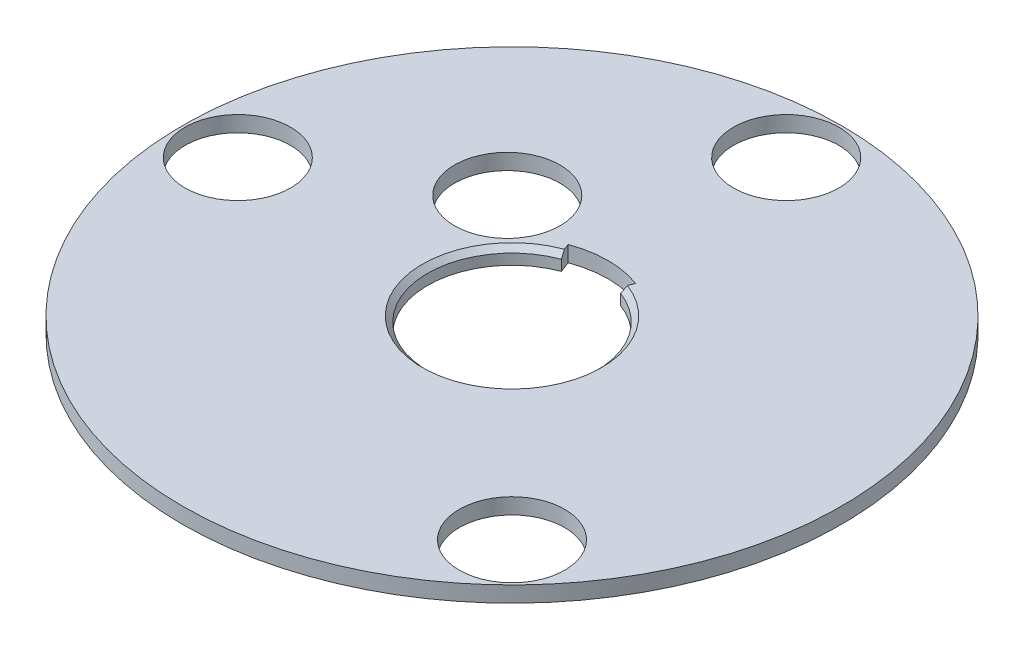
ISO-10303-21;
HEADER;
FILE_DESCRIPTION(('STEP AP214'),'2;1');
FILE_NAME('part.step','',(''),(''),'','','');
FILE_SCHEMA(('AUTOMOTIVE_DESIGN { 1 0 10303 214 1 1 1 1 }'));
ENDSEC;
DATA;
#1=APPLICATION_CONTEXT('core data for automotive mechanical design processes');
#2=APPLICATION_PROTOCOL_DEFINITION('international standard','automotive_design',2000,#1);
#3=PRODUCT_CONTEXT('',#1,'mechanical');
#4=PRODUCT('Part','Part','',(#3));
#5=PRODUCT_RELATED_PRODUCT_CATEGORY('part','',(#4));
#6=PRODUCT_DEFINITION_FORMATION('','',#4);
#7=PRODUCT_DEFINITION_CONTEXT('part definition',#1,'design');
#8=PRODUCT_DEFINITION('design','',#6,#7);
#9=PRODUCT_DEFINITION_SHAPE('','',#8);
#10=(LENGTH_UNIT() NAMED_UNIT(*) SI_UNIT(.MILLI.,.METRE.));
#11=(NAMED_UNIT(*) PLANE_ANGLE_UNIT() SI_UNIT($,.RADIAN.));
#12=(NAMED_UNIT(*) SI_UNIT($,.STERADIAN.) SOLID_ANGLE_UNIT());
#13=UNCERTAINTY_MEASURE_WITH_UNIT(LENGTH_MEASURE(1.E-05),#10,'distance_accuracy_value','');
#14=(GEOMETRIC_REPRESENTATION_CONTEXT(3) GLOBAL_UNCERTAINTY_ASSIGNED_CONTEXT((#13)) GLOBAL_UNIT_ASSIGNED_CONTEXT((#10,
#11,#12)) REPRESENTATION_CONTEXT('',''));
#15=CARTESIAN_POINT('',(0.,0.,0.));
#16=DIRECTION('',(0.,0.,1.));
#17=DIRECTION('',(1.,0.,0.));
#18=AXIS2_PLACEMENT_3D('',#15,#16,#17);
#19=CARTESIAN_POINT('',(0.,-1.5,0.));
#20=DIRECTION('',(0.,1.,0.));
#21=DIRECTION('',(0.,0.,1.));
#22=AXIS2_PLACEMENT_3D('',#19,#20,#21);
#23=CYLINDRICAL_SURFACE('',#22,31.25);
#24=CARTESIAN_POINT('',(0.,-1.5,0.));
#25=DIRECTION('',(0.,1.,0.));
#26=DIRECTION('',(0.,0.,1.));
#27=AXIS2_PLACEMENT_3D('',#24,#25,#26);
#28=CIRCLE('',#27,31.25);
#29=CARTESIAN_POINT('',(0.,-1.5,31.25));
#30=VERTEX_POINT('',#29);
#31=EDGE_CURVE('E121',#30,#30,#28,.T.);
#32=ORIENTED_EDGE('',*,*,#31,.T.);
#33=EDGE_LOOP('',(#32));
#34=FACE_BOUND('',#33,.T.);
#35=CARTESIAN_POINT('',(0.,0.,0.));
#36=DIRECTION('',(0.,1.,0.));
#37=DIRECTION('',(0.,0.,1.));
#38=AXIS2_PLACEMENT_3D('',#35,#36,#37);
#39=CIRCLE('',#38,31.25);
#40=CARTESIAN_POINT('',(0.,0.,31.25));
#41=VERTEX_POINT('',#40);
#42=EDGE_CURVE('E116',#41,#41,#39,.T.);
#43=ORIENTED_EDGE('',*,*,#42,.F.);
#44=EDGE_LOOP('',(#43));
#45=FACE_BOUND('',#44,.T.);
#46=ADVANCED_FACE('F32',(#34,#45),#23,.T.);
#47=CARTESIAN_POINT('',(0.,-1.5,0.));
#48=DIRECTION('',(0.,1.,0.));
#49=DIRECTION('',(0.,0.,1.));
#50=AXIS2_PLACEMENT_3D('',#47,#48,#49);
#51=PLANE('',#50);
#52=CARTESIAN_POINT('',(-25.9999999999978,-1.5,2.21689333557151E-12));
#53=DIRECTION('',(0.,1.,0.));
#54=DIRECTION('',(0.,0.,1.));
#55=AXIS2_PLACEMENT_3D('',#52,#53,#54);
#56=CIRCLE('',#55,5.00000000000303);
#57=CARTESIAN_POINT('',(-25.9999999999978,-1.5,5.00000000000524));
#58=VERTEX_POINT('',#57);
#59=EDGE_CURVE('E179',#58,#58,#56,.T.);
#60=ORIENTED_EDGE('',*,*,#59,.T.);
#61=EDGE_LOOP('',(#60));
#62=FACE_BOUND('',#61,.T.);
#63=CARTESIAN_POINT('',(18.384776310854,-1.5,18.3847763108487));
#64=DIRECTION('',(0.,1.,0.));
#65=DIRECTION('',(0.,0.,1.));
#66=AXIS2_PLACEMENT_3D('',#63,#64,#65);
#67=CIRCLE('',#66,5.00000000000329);
#68=CARTESIAN_POINT('',(18.384776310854,-1.5,23.384776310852));
#69=VERTEX_POINT('',#68);
#70=EDGE_CURVE('E187',#69,#69,#67,.T.);
#71=ORIENTED_EDGE('',*,*,#70,.T.);
#72=EDGE_LOOP('',(#71));
#73=FACE_BOUND('',#72,.T.);
#74=CARTESIAN_POINT('',(-10.1214166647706,-1.5,-9.67248286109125));
#75=DIRECTION('',(0.,1.,0.));
#76=DIRECTION('',(0.,0.,1.));
#77=AXIS2_PLACEMENT_3D('',#74,#75,#76);
#78=CIRCLE('',#77,5.);
#79=CARTESIAN_POINT('',(-10.1214166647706,-1.5,-4.67248286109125));
#80=VERTEX_POINT('',#79);
#81=EDGE_CURVE('E193',#80,#80,#78,.T.);
#82=ORIENTED_EDGE('',*,*,#81,.T.);
#83=EDGE_LOOP('',(#82));
#84=FACE_BOUND('',#83,.T.);
#85=CARTESIAN_POINT('',(0.,-1.5,-26.));
#86=DIRECTION('',(0.,1.,0.));
#87=DIRECTION('',(0.,0.,1.));
#88=AXIS2_PLACEMENT_3D('',#85,#86,#87);
#89=CIRCLE('',#88,5.);
#90=CARTESIAN_POINT('',(0.,-1.5,-21.));
#91=VERTEX_POINT('',#90);
#92=EDGE_CURVE('E112',#91,#91,#89,.T.);
#93=ORIENTED_EDGE('',*,*,#92,.T.);
#94=EDGE_LOOP('',(#93));
#95=FACE_BOUND('',#94,.T.);
#96=CARTESIAN_POINT('',(0.,-1.5,0.));
#97=DIRECTION('',(0.,1.,0.));
#98=DIRECTION('',(0.,0.,1.));
#99=AXIS2_PLACEMENT_3D('',#96,#97,#98);
#100=CIRCLE('',#99,8.);
#101=CARTESIAN_POINT('',(-2.80898753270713,-1.5,-7.49063342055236));
#102=VERTEX_POINT('',#101);
#103=CARTESIAN_POINT('',(2.80898753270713,-1.5,-7.49063342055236));
#104=VERTEX_POINT('',#103);
#105=EDGE_CURVE('E87',#102,#104,#100,.T.);
#106=ORIENTED_EDGE('',*,*,#105,.T.);
#107=DIRECTION('',(0.351123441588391,0.,-0.936329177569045));
#108=VECTOR('',#107,1.);
#109=CARTESIAN_POINT('',(3.,-1.5,-8.));
#110=LINE('',#109,#108);
#111=CARTESIAN_POINT('',(3.19522331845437,-1.5,-8.5205955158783));
#112=VERTEX_POINT('',#111);
#113=EDGE_CURVE('E80',#104,#112,#110,.T.);
#114=ORIENTED_EDGE('',*,*,#113,.T.);
#115=CARTESIAN_POINT('',(0.,-1.5,0.));
#116=DIRECTION('',(0.,1.,0.));
#117=DIRECTION('',(0.,0.,1.));
#118=AXIS2_PLACEMENT_3D('',#115,#116,#117);
#119=CIRCLE('',#118,9.1);
#120=CARTESIAN_POINT('',(-3.19522331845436,-1.5,-8.52059551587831));
#121=VERTEX_POINT('',#120);
#122=EDGE_CURVE('E91',#112,#121,#119,.T.);
#123=ORIENTED_EDGE('',*,*,#122,.T.);
#124=DIRECTION('',(0.351123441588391,0.,0.936329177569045));
#125=VECTOR('',#124,1.);
#126=CARTESIAN_POINT('',(-3.,-1.5,-8.));
#127=LINE('',#126,#125);
#128=EDGE_CURVE('E95',#121,#102,#127,.T.);
#129=ORIENTED_EDGE('',*,*,#128,.T.);
#130=EDGE_LOOP('',(#106,#114,#123,#129));
#131=FACE_BOUND('',#130,.T.);
#132=ORIENTED_EDGE('',*,*,#31,.F.);
#133=EDGE_LOOP('',(#132));
#134=FACE_BOUND('',#133,.T.);
#135=ADVANCED_FACE('F98',(#62,#73,#84,#95,#131,#134),#51,.F.);
#136=CARTESIAN_POINT('',(0.,0.,0.));
#137=DIRECTION('',(0.,1.,0.));
#138=DIRECTION('',(0.,0.,1.));
#139=AXIS2_PLACEMENT_3D('',#136,#137,#138);
#140=PLANE('',#139);
#141=CARTESIAN_POINT('',(-25.9999999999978,0.,2.21689333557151E-12));
#142=DIRECTION('',(0.,1.,0.));
#143=DIRECTION('',(0.,0.,1.));
#144=AXIS2_PLACEMENT_3D('',#141,#142,#143);
#145=CIRCLE('',#144,5.00000000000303);
#146=CARTESIAN_POINT('',(-25.9999999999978,0.,5.00000000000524));
#147=VERTEX_POINT('',#146);
#148=EDGE_CURVE('E182',#147,#147,#145,.T.);
#149=ORIENTED_EDGE('',*,*,#148,.F.);
#150=EDGE_LOOP('',(#149));
#151=FACE_BOUND('',#150,.T.);
#152=CARTESIAN_POINT('',(18.384776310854,0.,18.3847763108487));
#153=DIRECTION('',(0.,1.,0.));
#154=DIRECTION('',(0.,0.,1.));
#155=AXIS2_PLACEMENT_3D('',#152,#153,#154);
#156=CIRCLE('',#155,5.00000000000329);
#157=CARTESIAN_POINT('',(18.384776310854,0.,23.384776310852));
#158=VERTEX_POINT('',#157);
#159=EDGE_CURVE('E184',#158,#158,#156,.T.);
#160=ORIENTED_EDGE('',*,*,#159,.F.);
#161=EDGE_LOOP('',(#160));
#162=FACE_BOUND('',#161,.T.);
#163=CARTESIAN_POINT('',(-10.1214166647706,0.,-9.67248286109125));
#164=DIRECTION('',(0.,1.,0.));
#165=DIRECTION('',(0.,0.,1.));
#166=AXIS2_PLACEMENT_3D('',#163,#164,#165);
#167=CIRCLE('',#166,5.);
#168=CARTESIAN_POINT('',(-10.1214166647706,0.,-4.67248286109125));
#169=VERTEX_POINT('',#168);
#170=EDGE_CURVE('E190',#169,#169,#167,.T.);
#171=ORIENTED_EDGE('',*,*,#170,.F.);
#172=EDGE_LOOP('',(#171));
#173=FACE_BOUND('',#172,.T.);
#174=CARTESIAN_POINT('',(0.,0.,-26.));
#175=DIRECTION('',(0.,1.,0.));
#176=DIRECTION('',(0.,0.,1.));
#177=AXIS2_PLACEMENT_3D('',#174,#175,#176);
#178=CIRCLE('',#177,5.);
#179=CARTESIAN_POINT('',(0.,0.,-21.));
#180=VERTEX_POINT('',#179);
#181=EDGE_CURVE('E105',#180,#180,#178,.T.);
#182=ORIENTED_EDGE('',*,*,#181,.F.);
#183=EDGE_LOOP('',(#182));
#184=FACE_BOUND('',#183,.T.);
#185=DIRECTION('',(0.351123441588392,0.,-0.936329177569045));
#186=VECTOR('',#185,1.);
#187=CARTESIAN_POINT('',(2.80898753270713,0.,-7.49063342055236));
#188=LINE('',#187,#186);
#189=CARTESIAN_POINT('',(2.98454925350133,0.,-7.95879800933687));
#190=VERTEX_POINT('',#189);
#191=CARTESIAN_POINT('',(3.19522331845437,0.,-8.52059551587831));
#192=VERTEX_POINT('',#191);
#193=EDGE_CURVE('E82',#190,#192,#188,.T.);
#194=ORIENTED_EDGE('',*,*,#193,.F.);
#195=CARTESIAN_POINT('',(0.,0.,0.));
#196=DIRECTION('',(0.,1.,0.));
#197=DIRECTION('',(0.,0.,1.));
#198=AXIS2_PLACEMENT_3D('',#195,#196,#197);
#199=CIRCLE('',#198,8.49999999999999);
#200=CARTESIAN_POINT('',(-2.98454925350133,0.,-7.95879800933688));
#201=VERTEX_POINT('',#200);
#202=EDGE_CURVE('E40',#190,#201,#199,.F.);
#203=ORIENTED_EDGE('',*,*,#202,.T.);
#204=DIRECTION('',(0.351123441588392,0.,0.936329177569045));
#205=VECTOR('',#204,1.);
#206=CARTESIAN_POINT('',(-2.80898753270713,0.,-7.49063342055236));
#207=LINE('',#206,#205);
#208=CARTESIAN_POINT('',(-3.19522331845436,0.,-8.52059551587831));
#209=VERTEX_POINT('',#208);
#210=EDGE_CURVE('E102',#209,#201,#207,.T.);
#211=ORIENTED_EDGE('',*,*,#210,.F.);
#212=CARTESIAN_POINT('',(0.,0.,0.));
#213=DIRECTION('',(0.,1.,0.));
#214=DIRECTION('',(0.,0.,1.));
#215=AXIS2_PLACEMENT_3D('',#212,#213,#214);
#216=CIRCLE('',#215,9.1);
#217=EDGE_CURVE('E110',#192,#209,#216,.T.);
#218=ORIENTED_EDGE('',*,*,#217,.F.);
#219=EDGE_LOOP('',(#194,#203,#211,#218));
#220=FACE_BOUND('',#219,.T.);
#221=ORIENTED_EDGE('',*,*,#42,.T.);
#222=EDGE_LOOP('',(#221));
#223=FACE_BOUND('',#222,.T.);
#224=ADVANCED_FACE('F136',(#151,#162,#173,#184,#220,#223),#140,.T.);
#225=CARTESIAN_POINT('',(2.80898753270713,-1.5,-7.49063342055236));
#226=DIRECTION('',(0.936329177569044,0.,0.351123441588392));
#227=DIRECTION('',(0.351123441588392,0.,-0.936329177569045));
#228=AXIS2_PLACEMENT_3D('',#225,#226,#227);
#229=PLANE('',#228);
#230=DIRECTION('',(0.,1.,0.));
#231=VECTOR('',#230,1.);
#232=CARTESIAN_POINT('',(2.80898753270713,-1.5,-7.49063342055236));
#233=LINE('',#232,#231);
#234=CARTESIAN_POINT('',(2.80898753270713,-0.49999999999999,-7.49063342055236));
#235=VERTEX_POINT('',#234);
#236=EDGE_CURVE('E114',#104,#235,#233,.T.);
#237=ORIENTED_EDGE('',*,*,#236,.T.);
#238=DIRECTION('',(0.24828176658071,0.707106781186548,-0.662084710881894));
#239=VECTOR('',#238,1.);
#240=CARTESIAN_POINT('',(0.,-8.49999999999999,0.));
#241=LINE('',#240,#239);
#242=EDGE_CURVE('E54',#235,#190,#241,.T.);
#243=ORIENTED_EDGE('',*,*,#242,.T.);
#244=ORIENTED_EDGE('',*,*,#193,.T.);
#245=DIRECTION('',(0.,1.,0.));
#246=VECTOR('',#245,1.);
#247=CARTESIAN_POINT('',(3.19522331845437,-1.5,-8.5205955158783));
#248=LINE('',#247,#246);
#249=EDGE_CURVE('E76',#112,#192,#248,.T.);
#250=ORIENTED_EDGE('',*,*,#249,.F.);
#251=ORIENTED_EDGE('',*,*,#113,.F.);
#252=EDGE_LOOP('',(#237,#243,#244,#250,#251));
#253=FACE_BOUND('',#252,.T.);
#254=ADVANCED_FACE('F78',(#253),#229,.F.);
#255=CARTESIAN_POINT('',(0.,-1.5,0.));
#256=DIRECTION('',(0.,1.,0.));
#257=DIRECTION('',(0.,0.,1.));
#258=AXIS2_PLACEMENT_3D('',#255,#256,#257);
#259=CYLINDRICAL_SURFACE('',#258,8.);
#260=DIRECTION('',(0.,1.,0.));
#261=VECTOR('',#260,1.);
#262=CARTESIAN_POINT('',(-2.80898753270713,-1.5,-7.49063342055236));
#263=LINE('',#262,#261);
#264=CARTESIAN_POINT('',(-2.80898753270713,-0.49999999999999,-7.49063342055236));
#265=VERTEX_POINT('',#264);
#266=EDGE_CURVE('E117',#102,#265,#263,.T.);
#267=ORIENTED_EDGE('',*,*,#266,.T.);
#268=CARTESIAN_POINT('',(0.,-0.499999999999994,0.));
#269=DIRECTION('',(0.,1.,0.));
#270=DIRECTION('',(0.,0.,1.));
#271=AXIS2_PLACEMENT_3D('',#268,#269,#270);
#272=CIRCLE('',#271,8.);
#273=EDGE_CURVE('E124',#265,#235,#272,.T.);
#274=ORIENTED_EDGE('',*,*,#273,.T.);
#275=ORIENTED_EDGE('',*,*,#236,.F.);
#276=ORIENTED_EDGE('',*,*,#105,.F.);
#277=EDGE_LOOP('',(#267,#274,#275,#276));
#278=FACE_BOUND('',#277,.T.);
#279=ADVANCED_FACE('F131',(#278),#259,.F.);
#280=CARTESIAN_POINT('',(-2.80898753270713,-1.5,-7.49063342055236));
#281=DIRECTION('',(-0.936329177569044,0.,0.351123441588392));
#282=DIRECTION('',(0.351123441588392,0.,0.936329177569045));
#283=AXIS2_PLACEMENT_3D('',#280,#281,#282);
#284=PLANE('',#283);
#285=ORIENTED_EDGE('',*,*,#210,.T.);
#286=DIRECTION('',(0.24828176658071,-0.707106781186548,0.662084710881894));
#287=VECTOR('',#286,1.);
#288=CARTESIAN_POINT('',(0.,-8.49999999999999,0.));
#289=LINE('',#288,#287);
#290=EDGE_CURVE('E11',#201,#265,#289,.T.);
#291=ORIENTED_EDGE('',*,*,#290,.T.);
#292=ORIENTED_EDGE('',*,*,#266,.F.);
#293=ORIENTED_EDGE('',*,*,#128,.F.);
#294=DIRECTION('',(0.,1.,0.));
#295=VECTOR('',#294,1.);
#296=CARTESIAN_POINT('',(-3.19522331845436,-1.5,-8.52059551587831));
#297=LINE('',#296,#295);
#298=EDGE_CURVE('E86',#121,#209,#297,.T.);
#299=ORIENTED_EDGE('',*,*,#298,.T.);
#300=EDGE_LOOP('',(#285,#291,#292,#293,#299));
#301=FACE_BOUND('',#300,.T.);
#302=ADVANCED_FACE('F135',(#301),#284,.F.);
#303=CARTESIAN_POINT('',(0.,-1.5,0.));
#304=DIRECTION('',(0.,1.,0.));
#305=DIRECTION('',(0.,0.,1.));
#306=AXIS2_PLACEMENT_3D('',#303,#304,#305);
#307=CYLINDRICAL_SURFACE('',#306,9.1);
#308=ORIENTED_EDGE('',*,*,#217,.T.);
#309=ORIENTED_EDGE('',*,*,#298,.F.);
#310=ORIENTED_EDGE('',*,*,#122,.F.);
#311=ORIENTED_EDGE('',*,*,#249,.T.);
#312=EDGE_LOOP('',(#308,#309,#310,#311));
#313=FACE_BOUND('',#312,.T.);
#314=ADVANCED_FACE('F92',(#313),#307,.F.);
#315=CARTESIAN_POINT('',(0.,-0.499999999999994,0.));
#316=DIRECTION('',(0.,1.,0.));
#317=DIRECTION('',(0.,0.,1.));
#318=AXIS2_PLACEMENT_3D('',#315,#316,#317);
#319=CONICAL_SURFACE('',#318,8.,0.785398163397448);
#320=ORIENTED_EDGE('',*,*,#290,.F.);
#321=ORIENTED_EDGE('',*,*,#202,.F.);
#322=ORIENTED_EDGE('',*,*,#242,.F.);
#323=ORIENTED_EDGE('',*,*,#273,.F.);
#324=EDGE_LOOP('',(#320,#321,#322,#323));
#325=FACE_BOUND('',#324,.T.);
#326=ADVANCED_FACE('F34',(#325),#319,.F.);
#327=CARTESIAN_POINT('',(0.,-1.5,-26.));
#328=DIRECTION('',(0.,1.,0.));
#329=DIRECTION('',(0.,0.,1.));
#330=AXIS2_PLACEMENT_3D('',#327,#328,#329);
#331=CYLINDRICAL_SURFACE('',#330,5.);
#332=ORIENTED_EDGE('',*,*,#92,.F.);
#333=EDGE_LOOP('',(#332));
#334=FACE_BOUND('',#333,.T.);
#335=ORIENTED_EDGE('',*,*,#181,.T.);
#336=EDGE_LOOP('',(#335));
#337=FACE_BOUND('',#336,.T.);
#338=ADVANCED_FACE('F159',(#334,#337),#331,.F.);
#339=CARTESIAN_POINT('',(-10.1214166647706,-1.5,-9.67248286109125));
#340=DIRECTION('',(0.,1.,0.));
#341=DIRECTION('',(0.,0.,1.));
#342=AXIS2_PLACEMENT_3D('',#339,#340,#341);
#343=CYLINDRICAL_SURFACE('',#342,5.);
#344=ORIENTED_EDGE('',*,*,#81,.F.);
#345=EDGE_LOOP('',(#344));
#346=FACE_BOUND('',#345,.T.);
#347=ORIENTED_EDGE('',*,*,#170,.T.);
#348=EDGE_LOOP('',(#347));
#349=FACE_BOUND('',#348,.T.);
#350=ADVANCED_FACE('F162',(#346,#349),#343,.F.);
#351=CARTESIAN_POINT('',(18.384776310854,-1.5,18.3847763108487));
#352=DIRECTION('',(0.,1.,0.));
#353=DIRECTION('',(0.,0.,1.));
#354=AXIS2_PLACEMENT_3D('',#351,#352,#353);
#355=CYLINDRICAL_SURFACE('',#354,5.00000000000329);
#356=ORIENTED_EDGE('',*,*,#70,.F.);
#357=EDGE_LOOP('',(#356));
#358=FACE_BOUND('',#357,.T.);
#359=ORIENTED_EDGE('',*,*,#159,.T.);
#360=EDGE_LOOP('',(#359));
#361=FACE_BOUND('',#360,.T.);
#362=ADVANCED_FACE('F166',(#358,#361),#355,.F.);
#363=CARTESIAN_POINT('',(-25.9999999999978,-1.5,2.21689333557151E-12));
#364=DIRECTION('',(0.,1.,0.));
#365=DIRECTION('',(0.,0.,1.));
#366=AXIS2_PLACEMENT_3D('',#363,#364,#365);
#367=CYLINDRICAL_SURFACE('',#366,5.00000000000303);
#368=ORIENTED_EDGE('',*,*,#59,.F.);
#369=EDGE_LOOP('',(#368));
#370=FACE_BOUND('',#369,.T.);
#371=ORIENTED_EDGE('',*,*,#148,.T.);
#372=EDGE_LOOP('',(#371));
#373=FACE_BOUND('',#372,.T.);
#374=ADVANCED_FACE('F170',(#370,#373),#367,.F.);
#375=CLOSED_SHELL('',(#46,#135,#224,#254,#279,#302,#314,#326,#338,#350,#362,#374));
#376=MANIFOLD_SOLID_BREP('B2',#375);
#377=ADVANCED_BREP_SHAPE_REPRESENTATION('',(#18,#376),#14);
#378=SHAPE_DEFINITION_REPRESENTATION(#9,#377);
ENDSEC;
END-ISO-10303-21;
